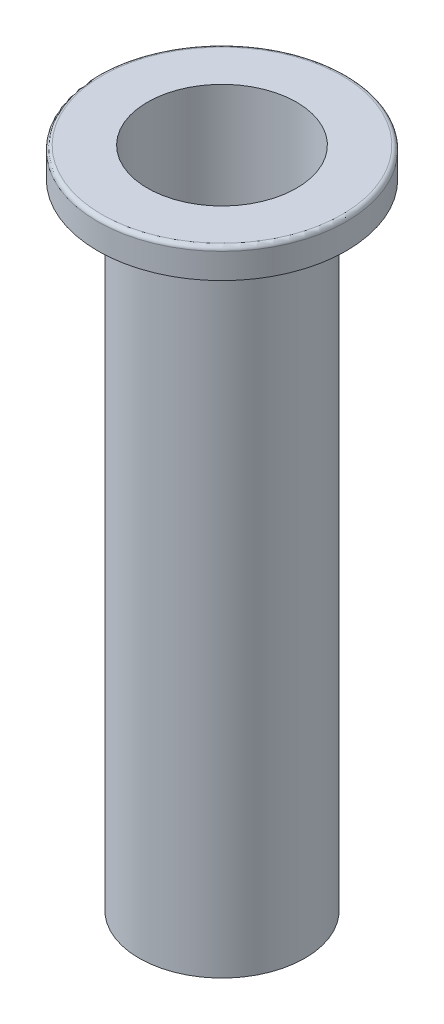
from build123d import *

# Parameters (mm, degrees)
CROQUIS1_R              = 20
SALIENTE_EXTRUIR1_DEPTH = 150
CROQUIS2_R              = 30
SALIENTE_EXTRUIR2_DEPTH = 10
CROQUIS3_R              = 18
CORTAR_EXTRUIR1_DEPTH   = 166.529453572
CHAFL_N1_SIZE           = 5
CHAFL_N1_SIZE2          = 2.886751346
REDONDEO1_R             = 1


with BuildPart() as part:
    # Croquis1 → Saliente-Extruir1 (new body)
    with BuildSketch(Plane(origin=(0, 0, 0), x_dir=(1, 0, 0), z_dir=(0, 1, 0))):
        with Locations(Location((0, 0, 0), (0, 0, 270))):
            Circle(CROQUIS1_R)
    extrude(amount=-SALIENTE_EXTRUIR1_DEPTH)

    # Croquis2 → Saliente-Extruir2 (add)
    with BuildSketch(Plane(origin=(0, 0, 0), x_dir=(1, 0, 0), z_dir=(0, 1, 0))):
        with Locations(Location((0, 0, 0), (0, 0, 270))):
            Circle(CROQUIS2_R)
    extrude(amount=SALIENTE_EXTRUIR2_DEPTH)

    # Croquis3 → Cortar-Extruir1 (cut, through all)
    with BuildSketch(Plane.XZ.offset(150)):
        with Locations(Location((0, 0, 0), (0, 0, 270))):
            Circle(CROQUIS3_R)
    extrude(amount=-CORTAR_EXTRUIR1_DEPTH, mode=Mode.SUBTRACT)

    # Chafl_n1
    chafl_n1_edges = [part.edges().sort_by_distance(p)[0] for p in [
        (0, 0, -30),
    ]]
    chafl_n1_side = [part.faces().sort_by_distance(p)[0] for p in [
        (0, 0, -29.151471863),
    ]]
    chamfer(chafl_n1_edges, length=CHAFL_N1_SIZE, length2=CHAFL_N1_SIZE2, reference=chafl_n1_side[0])

    # Redondeo1
    redondeo1_edges = [part.edges().sort_by_distance(p)[0] for p in [
        (0, 10, -30),
    ]]
    fillet(redondeo1_edges, radius=REDONDEO1_R)


solid = part.part
